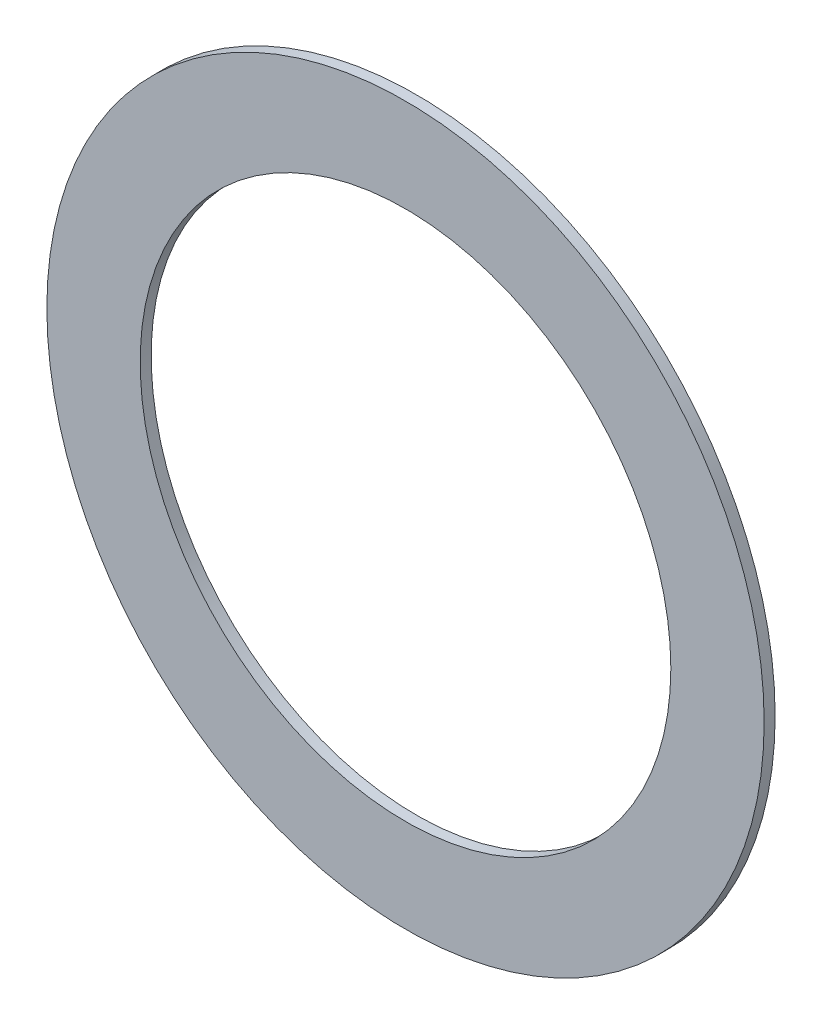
ISO-10303-21;
HEADER;
FILE_DESCRIPTION(('STEP AP214'),'2;1');
FILE_NAME('part.step','',(''),(''),'','','');
FILE_SCHEMA(('AUTOMOTIVE_DESIGN { 1 0 10303 214 1 1 1 1 }'));
ENDSEC;
DATA;
#1=APPLICATION_CONTEXT('core data for automotive mechanical design processes');
#2=APPLICATION_PROTOCOL_DEFINITION('international standard','automotive_design',2000,#1);
#3=PRODUCT_CONTEXT('',#1,'mechanical');
#4=PRODUCT('Part','Part','',(#3));
#5=PRODUCT_RELATED_PRODUCT_CATEGORY('part','',(#4));
#6=PRODUCT_DEFINITION_FORMATION('','',#4);
#7=PRODUCT_DEFINITION_CONTEXT('part definition',#1,'design');
#8=PRODUCT_DEFINITION('design','',#6,#7);
#9=PRODUCT_DEFINITION_SHAPE('','',#8);
#10=(LENGTH_UNIT() NAMED_UNIT(*) SI_UNIT(.MILLI.,.METRE.));
#11=(NAMED_UNIT(*) PLANE_ANGLE_UNIT() SI_UNIT($,.RADIAN.));
#12=(NAMED_UNIT(*) SI_UNIT($,.STERADIAN.) SOLID_ANGLE_UNIT());
#13=UNCERTAINTY_MEASURE_WITH_UNIT(LENGTH_MEASURE(1.E-05),#10,'distance_accuracy_value','');
#14=(GEOMETRIC_REPRESENTATION_CONTEXT(3) GLOBAL_UNCERTAINTY_ASSIGNED_CONTEXT((#13)) GLOBAL_UNIT_ASSIGNED_CONTEXT((#10,
#11,#12)) REPRESENTATION_CONTEXT('',''));
#15=CARTESIAN_POINT('',(0.,0.,0.));
#16=DIRECTION('',(0.,0.,1.));
#17=DIRECTION('',(1.,0.,0.));
#18=AXIS2_PLACEMENT_3D('',#15,#16,#17);
#19=CARTESIAN_POINT('',(0.,0.,0.3));
#20=DIRECTION('',(0.,0.,1.));
#21=DIRECTION('',(1.,0.,0.));
#22=AXIS2_PLACEMENT_3D('',#19,#20,#21);
#23=PLANE('',#22);
#24=CARTESIAN_POINT('',(0.,0.,0.3));
#25=DIRECTION('',(0.,0.,1.));
#26=DIRECTION('',(1.,0.,0.));
#27=AXIS2_PLACEMENT_3D('',#24,#25,#26);
#28=CIRCLE('',#27,9.8);
#29=CARTESIAN_POINT('',(9.8,0.,0.3));
#30=VERTEX_POINT('',#29);
#31=EDGE_CURVE('E10',#30,#30,#28,.T.);
#32=ORIENTED_EDGE('',*,*,#31,.T.);
#33=EDGE_LOOP('',(#32));
#34=FACE_BOUND('',#33,.T.);
#35=CARTESIAN_POINT('',(0.,0.,0.3));
#36=DIRECTION('',(0.,0.,1.));
#37=DIRECTION('',(1.,0.,0.));
#38=AXIS2_PLACEMENT_3D('',#35,#36,#37);
#39=CIRCLE('',#38,7.25);
#40=CARTESIAN_POINT('',(7.25,0.,0.3));
#41=VERTEX_POINT('',#40);
#42=EDGE_CURVE('E50',#41,#41,#39,.T.);
#43=ORIENTED_EDGE('',*,*,#42,.F.);
#44=EDGE_LOOP('',(#43));
#45=FACE_BOUND('',#44,.T.);
#46=ADVANCED_FACE('F37',(#34,#45),#23,.T.);
#47=CARTESIAN_POINT('',(0.,0.,0.));
#48=DIRECTION('',(0.,0.,1.));
#49=DIRECTION('',(1.,0.,0.));
#50=AXIS2_PLACEMENT_3D('',#47,#48,#49);
#51=PLANE('',#50);
#52=CARTESIAN_POINT('',(0.,0.,0.));
#53=DIRECTION('',(0.,0.,1.));
#54=DIRECTION('',(1.,0.,0.));
#55=AXIS2_PLACEMENT_3D('',#52,#53,#54);
#56=CIRCLE('',#55,9.8);
#57=CARTESIAN_POINT('',(9.8,0.,0.));
#58=VERTEX_POINT('',#57);
#59=EDGE_CURVE('E41',#58,#58,#56,.T.);
#60=ORIENTED_EDGE('',*,*,#59,.F.);
#61=EDGE_LOOP('',(#60));
#62=FACE_BOUND('',#61,.T.);
#63=CARTESIAN_POINT('',(0.,0.,0.));
#64=DIRECTION('',(0.,0.,1.));
#65=DIRECTION('',(1.,0.,0.));
#66=AXIS2_PLACEMENT_3D('',#63,#64,#65);
#67=CIRCLE('',#66,7.25);
#68=CARTESIAN_POINT('',(7.25,0.,0.));
#69=VERTEX_POINT('',#68);
#70=EDGE_CURVE('E52',#69,#69,#67,.T.);
#71=ORIENTED_EDGE('',*,*,#70,.T.);
#72=EDGE_LOOP('',(#71));
#73=FACE_BOUND('',#72,.T.);
#74=ADVANCED_FACE('F64',(#62,#73),#51,.F.);
#75=CARTESIAN_POINT('',(0.,0.,0.3));
#76=DIRECTION('',(0.,0.,-1.));
#77=DIRECTION('',(-1.,0.,0.));
#78=AXIS2_PLACEMENT_3D('',#75,#76,#77);
#79=CYLINDRICAL_SURFACE('',#78,9.8);
#80=ORIENTED_EDGE('',*,*,#31,.F.);
#81=EDGE_LOOP('',(#80));
#82=FACE_BOUND('',#81,.T.);
#83=ORIENTED_EDGE('',*,*,#59,.T.);
#84=EDGE_LOOP('',(#83));
#85=FACE_BOUND('',#84,.T.);
#86=ADVANCED_FACE('F39',(#82,#85),#79,.T.);
#87=CARTESIAN_POINT('',(0.,0.,0.3));
#88=DIRECTION('',(0.,0.,-1.));
#89=DIRECTION('',(-1.,0.,0.));
#90=AXIS2_PLACEMENT_3D('',#87,#88,#89);
#91=CYLINDRICAL_SURFACE('',#90,7.25);
#92=ORIENTED_EDGE('',*,*,#42,.T.);
#93=EDGE_LOOP('',(#92));
#94=FACE_BOUND('',#93,.T.);
#95=ORIENTED_EDGE('',*,*,#70,.F.);
#96=EDGE_LOOP('',(#95));
#97=FACE_BOUND('',#96,.T.);
#98=ADVANCED_FACE('F60',(#94,#97),#91,.F.);
#99=CLOSED_SHELL('',(#46,#74,#86,#98));
#100=MANIFOLD_SOLID_BREP('B2',#99);
#101=ADVANCED_BREP_SHAPE_REPRESENTATION('',(#18,#100),#14);
#102=SHAPE_DEFINITION_REPRESENTATION(#9,#101);
ENDSEC;
END-ISO-10303-21;
